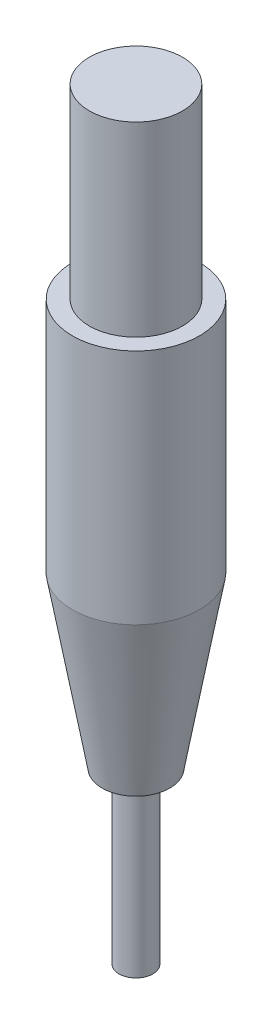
from build123d import *


with BuildPart() as part:
    # Esquisse1 → R_volution1 (revolve)
    with BuildSketch(Plane(origin=(0, 0, 0), x_dir=(0, 0, -1), z_dir=(1, 0, 0))):
        Polygon((0, 4.624331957), (-1, 4.624331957), (-1, 14.624331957), (-2, 14.624331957), (-3.75, 24.624331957), (-3.75, 38.624331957), (-2.75, 38.624331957), (-2.75, 49.624331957), (0, 49.624331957), align=None)
    revolve(axis=Axis((0, 32.035961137, 0), (0, -1, 0)))


solid = part.part
